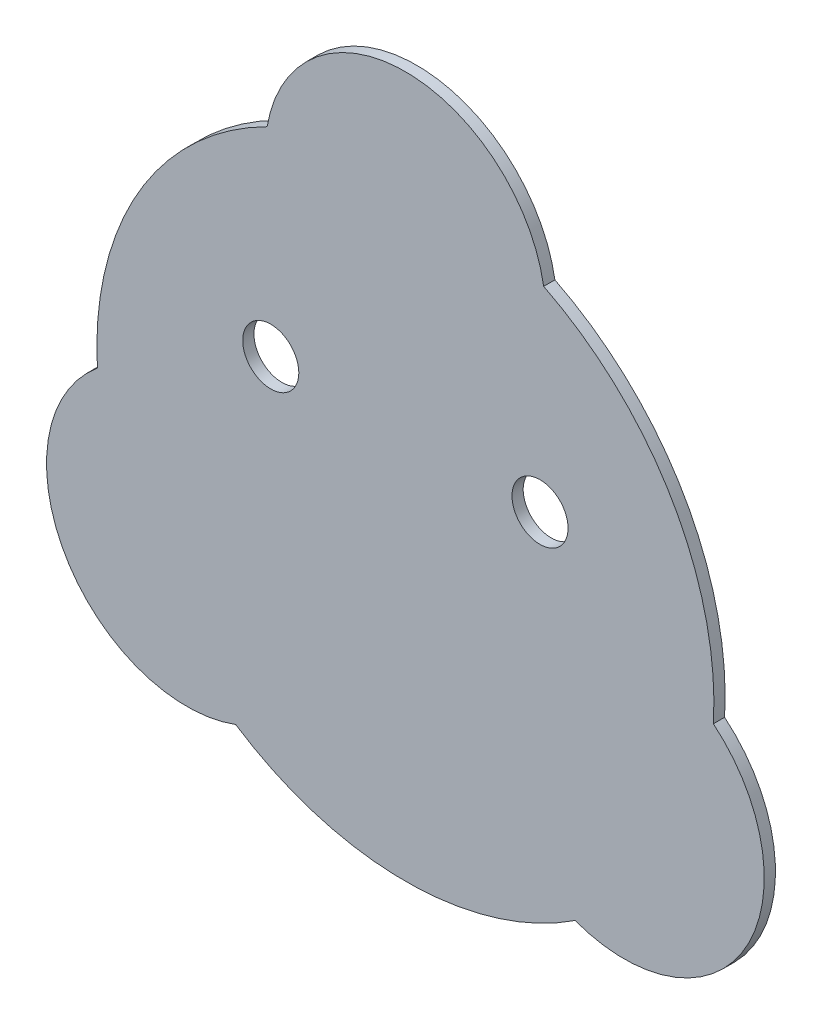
from build123d import *

# Parameters (mm, degrees)
SKETCH_1_R      = 2.5
EXTRUDE_1_DEPTH = 1


with BuildPart() as part:
    # Sketch 1 → Extrude 1 (new body)
    with BuildSketch(Plane.XY.offset(-2001)):
        with BuildLine():
            ThreePointArc((-449.243790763, 1299.914572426), (-434.116582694, 1295.380146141), (-418.989374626, 1299.914572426))
            ThreePointArc((-418.989374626, 1299.914572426), (-403.805693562, 1305.380146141), (-406.664208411, 1321.262386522))
            ThreePointArc((-406.664208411, 1321.262386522), (-410.30088409, 1336.630146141), (-421.79141648, 1347.463479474))
            ThreePointArc((-421.79141648, 1347.463479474), (-434.116582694, 1357.880146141), (-446.441748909, 1347.463479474))
            ThreePointArc((-446.441748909, 1347.463479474), (-457.932281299, 1336.630146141), (-461.568956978, 1321.262386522))
            ThreePointArc((-461.568956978, 1321.262386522), (-464.427471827, 1305.380146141), (-449.243790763, 1299.914572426))
        make_face()
        with Locations((-422.116582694, 1329.880146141)):
            Circle(SKETCH_1_R, mode=Mode.SUBTRACT)
        with Locations((-446.116582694, 1329.880146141)):
            Circle(SKETCH_1_R, mode=Mode.SUBTRACT)
    extrude(amount=EXTRUDE_1_DEPTH)


solid = part.part
